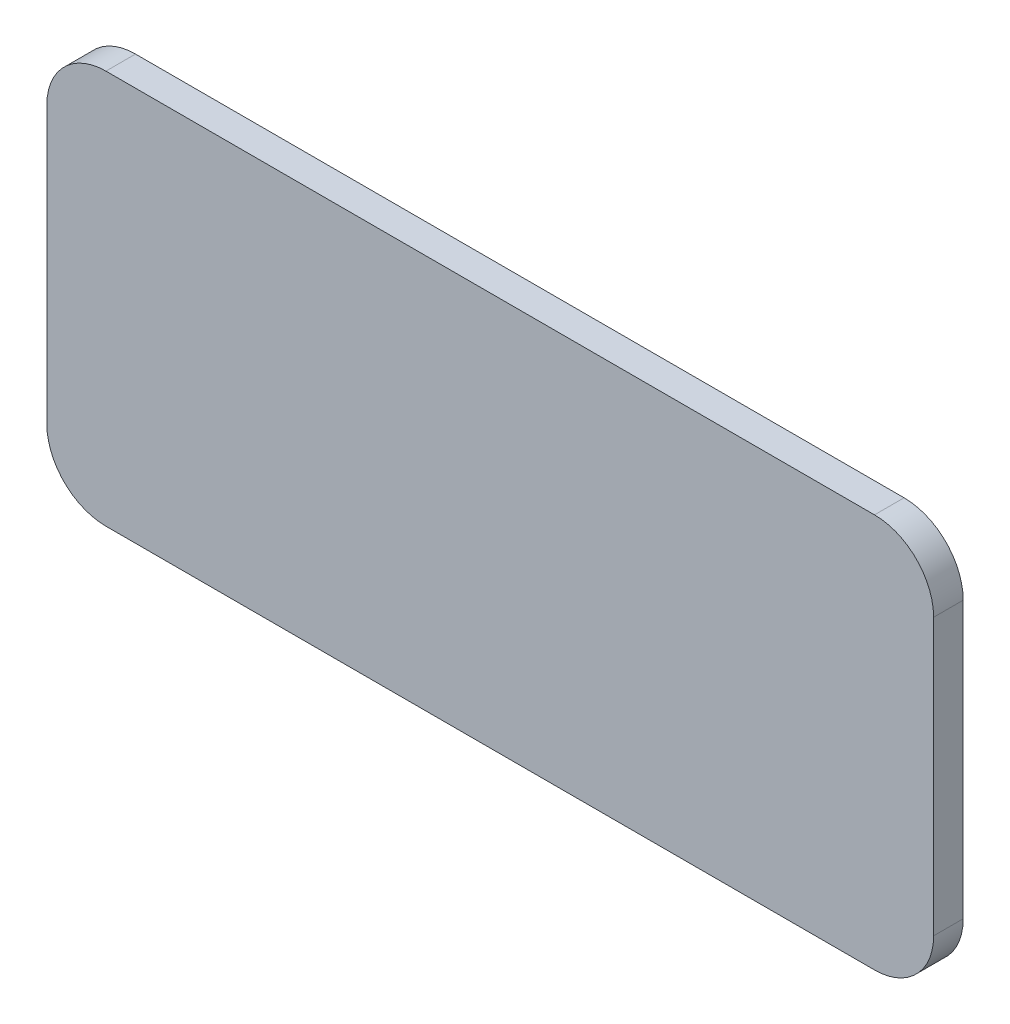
ISO-10303-21;
HEADER;
FILE_DESCRIPTION(('STEP AP214'),'2;1');
FILE_NAME('part.step','',(''),(''),'','','');
FILE_SCHEMA(('AUTOMOTIVE_DESIGN { 1 0 10303 214 1 1 1 1 }'));
ENDSEC;
DATA;
#1=APPLICATION_CONTEXT('core data for automotive mechanical design processes');
#2=APPLICATION_PROTOCOL_DEFINITION('international standard','automotive_design',2000,#1);
#3=PRODUCT_CONTEXT('',#1,'mechanical');
#4=PRODUCT('Part','Part','',(#3));
#5=PRODUCT_RELATED_PRODUCT_CATEGORY('part','',(#4));
#6=PRODUCT_DEFINITION_FORMATION('','',#4);
#7=PRODUCT_DEFINITION_CONTEXT('part definition',#1,'design');
#8=PRODUCT_DEFINITION('design','',#6,#7);
#9=PRODUCT_DEFINITION_SHAPE('','',#8);
#10=(LENGTH_UNIT() NAMED_UNIT(*) SI_UNIT(.MILLI.,.METRE.));
#11=(NAMED_UNIT(*) PLANE_ANGLE_UNIT() SI_UNIT($,.RADIAN.));
#12=(NAMED_UNIT(*) SI_UNIT($,.STERADIAN.) SOLID_ANGLE_UNIT());
#13=UNCERTAINTY_MEASURE_WITH_UNIT(LENGTH_MEASURE(1.E-05),#10,'distance_accuracy_value','');
#14=(GEOMETRIC_REPRESENTATION_CONTEXT(3) GLOBAL_UNCERTAINTY_ASSIGNED_CONTEXT((#13)) GLOBAL_UNIT_ASSIGNED_CONTEXT((#10,
#11,#12)) REPRESENTATION_CONTEXT('',''));
#15=CARTESIAN_POINT('',(0.,0.,0.));
#16=DIRECTION('',(0.,0.,1.));
#17=DIRECTION('',(1.,0.,0.));
#18=AXIS2_PLACEMENT_3D('',#15,#16,#17);
#19=CARTESIAN_POINT('',(58.,34.5,1.5));
#20=DIRECTION('',(0.,0.,-1.));
#21=DIRECTION('',(-1.,0.,0.));
#22=AXIS2_PLACEMENT_3D('',#19,#20,#21);
#23=CYLINDRICAL_SURFACE('',#22,3.);
#24=CARTESIAN_POINT('',(58.,34.5,0.));
#25=DIRECTION('',(0.,0.,1.));
#26=DIRECTION('',(1.,0.,0.));
#27=AXIS2_PLACEMENT_3D('',#24,#25,#26);
#28=CIRCLE('',#27,3.);
#29=CARTESIAN_POINT('',(58.,37.5,0.));
#30=VERTEX_POINT('',#29);
#31=CARTESIAN_POINT('',(55.,34.5,0.));
#32=VERTEX_POINT('',#31);
#33=EDGE_CURVE('E128',#30,#32,#28,.T.);
#34=ORIENTED_EDGE('',*,*,#33,.T.);
#35=DIRECTION('',(0.,0.,-1.));
#36=VECTOR('',#35,1.);
#37=CARTESIAN_POINT('',(55.,34.5,1.5));
#38=LINE('',#37,#36);
#39=CARTESIAN_POINT('',(55.,34.5,1.5));
#40=VERTEX_POINT('',#39);
#41=EDGE_CURVE('E11',#40,#32,#38,.T.);
#42=ORIENTED_EDGE('',*,*,#41,.F.);
#43=CARTESIAN_POINT('',(58.,34.5,1.5));
#44=DIRECTION('',(0.,0.,1.));
#45=DIRECTION('',(1.,0.,0.));
#46=AXIS2_PLACEMENT_3D('',#43,#44,#45);
#47=CIRCLE('',#46,3.);
#48=CARTESIAN_POINT('',(58.,37.5,1.5));
#49=VERTEX_POINT('',#48);
#50=EDGE_CURVE('E142',#49,#40,#47,.T.);
#51=ORIENTED_EDGE('',*,*,#50,.F.);
#52=DIRECTION('',(0.,0.,-1.));
#53=VECTOR('',#52,1.);
#54=CARTESIAN_POINT('',(58.,37.5,1.5));
#55=LINE('',#54,#53);
#56=EDGE_CURVE('E124',#49,#30,#55,.T.);
#57=ORIENTED_EDGE('',*,*,#56,.T.);
#58=EDGE_LOOP('',(#34,#42,#51,#57));
#59=FACE_BOUND('',#58,.T.);
#60=ADVANCED_FACE('F32',(#59),#23,.T.);
#61=CARTESIAN_POINT('',(55.,34.5,1.5));
#62=DIRECTION('',(1.,0.,0.));
#63=DIRECTION('',(0.,0.,-1.));
#64=AXIS2_PLACEMENT_3D('',#61,#62,#63);
#65=PLANE('',#64);
#66=DIRECTION('',(0.,-1.,0.));
#67=VECTOR('',#66,1.);
#68=CARTESIAN_POINT('',(55.,34.5,0.));
#69=LINE('',#68,#67);
#70=CARTESIAN_POINT('',(55.,20.5,0.));
#71=VERTEX_POINT('',#70);
#72=EDGE_CURVE('E131',#32,#71,#69,.T.);
#73=ORIENTED_EDGE('',*,*,#72,.T.);
#74=DIRECTION('',(0.,0.,-1.));
#75=VECTOR('',#74,1.);
#76=CARTESIAN_POINT('',(55.,20.5,1.5));
#77=LINE('',#76,#75);
#78=CARTESIAN_POINT('',(55.,20.5,1.5));
#79=VERTEX_POINT('',#78);
#80=EDGE_CURVE('E40',#79,#71,#77,.T.);
#81=ORIENTED_EDGE('',*,*,#80,.F.);
#82=DIRECTION('',(0.,-1.,0.));
#83=VECTOR('',#82,1.);
#84=CARTESIAN_POINT('',(55.,34.5,1.5));
#85=LINE('',#84,#83);
#86=EDGE_CURVE('E91',#40,#79,#85,.T.);
#87=ORIENTED_EDGE('',*,*,#86,.F.);
#88=ORIENTED_EDGE('',*,*,#41,.T.);
#89=EDGE_LOOP('',(#73,#81,#87,#88));
#90=FACE_BOUND('',#89,.T.);
#91=ADVANCED_FACE('F177',(#90),#65,.F.);
#92=CARTESIAN_POINT('',(58.,20.5,1.5));
#93=DIRECTION('',(0.,0.,-1.));
#94=DIRECTION('',(-1.,0.,0.));
#95=AXIS2_PLACEMENT_3D('',#92,#93,#94);
#96=CYLINDRICAL_SURFACE('',#95,3.);
#97=CARTESIAN_POINT('',(58.,20.5,0.));
#98=DIRECTION('',(0.,0.,1.));
#99=DIRECTION('',(1.,0.,0.));
#100=AXIS2_PLACEMENT_3D('',#97,#98,#99);
#101=CIRCLE('',#100,3.);
#102=CARTESIAN_POINT('',(58.,17.5,0.));
#103=VERTEX_POINT('',#102);
#104=EDGE_CURVE('E133',#71,#103,#101,.T.);
#105=ORIENTED_EDGE('',*,*,#104,.T.);
#106=DIRECTION('',(0.,0.,-1.));
#107=VECTOR('',#106,1.);
#108=CARTESIAN_POINT('',(58.,17.5,1.5));
#109=LINE('',#108,#107);
#110=CARTESIAN_POINT('',(58.,17.5,1.5));
#111=VERTEX_POINT('',#110);
#112=EDGE_CURVE('E149',#111,#103,#109,.T.);
#113=ORIENTED_EDGE('',*,*,#112,.F.);
#114=CARTESIAN_POINT('',(58.,20.5,1.5));
#115=DIRECTION('',(0.,0.,1.));
#116=DIRECTION('',(1.,0.,0.));
#117=AXIS2_PLACEMENT_3D('',#114,#115,#116);
#118=CIRCLE('',#117,3.);
#119=EDGE_CURVE('E157',#79,#111,#118,.T.);
#120=ORIENTED_EDGE('',*,*,#119,.F.);
#121=ORIENTED_EDGE('',*,*,#80,.T.);
#122=EDGE_LOOP('',(#105,#113,#120,#121));
#123=FACE_BOUND('',#122,.T.);
#124=ADVANCED_FACE('F155',(#123),#96,.T.);
#125=CARTESIAN_POINT('',(58.,17.5,1.5));
#126=DIRECTION('',(0.,1.,0.));
#127=DIRECTION('',(-1.,0.,0.));
#128=AXIS2_PLACEMENT_3D('',#125,#126,#127);
#129=PLANE('',#128);
#130=DIRECTION('',(1.,0.,0.));
#131=VECTOR('',#130,1.);
#132=CARTESIAN_POINT('',(58.,17.5,0.));
#133=LINE('',#132,#131);
#134=CARTESIAN_POINT('',(97.,17.5,0.));
#135=VERTEX_POINT('',#134);
#136=EDGE_CURVE('E135',#103,#135,#133,.T.);
#137=ORIENTED_EDGE('',*,*,#136,.T.);
#138=DIRECTION('',(0.,0.,-1.));
#139=VECTOR('',#138,1.);
#140=CARTESIAN_POINT('',(97.,17.5,1.5));
#141=LINE('',#140,#139);
#142=CARTESIAN_POINT('',(97.,17.5,1.5));
#143=VERTEX_POINT('',#142);
#144=EDGE_CURVE('E146',#143,#135,#141,.T.);
#145=ORIENTED_EDGE('',*,*,#144,.F.);
#146=DIRECTION('',(1.,0.,0.));
#147=VECTOR('',#146,1.);
#148=CARTESIAN_POINT('',(58.,17.5,1.5));
#149=LINE('',#148,#147);
#150=EDGE_CURVE('E169',#111,#143,#149,.T.);
#151=ORIENTED_EDGE('',*,*,#150,.F.);
#152=ORIENTED_EDGE('',*,*,#112,.T.);
#153=EDGE_LOOP('',(#137,#145,#151,#152));
#154=FACE_BOUND('',#153,.T.);
#155=ADVANCED_FACE('F165',(#154),#129,.F.);
#156=CARTESIAN_POINT('',(97.,20.5,1.5));
#157=DIRECTION('',(0.,0.,-1.));
#158=DIRECTION('',(-1.,0.,0.));
#159=AXIS2_PLACEMENT_3D('',#156,#157,#158);
#160=CYLINDRICAL_SURFACE('',#159,3.);
#161=CARTESIAN_POINT('',(97.,20.5,0.));
#162=DIRECTION('',(0.,0.,1.));
#163=DIRECTION('',(1.,0.,0.));
#164=AXIS2_PLACEMENT_3D('',#161,#162,#163);
#165=CIRCLE('',#164,3.);
#166=CARTESIAN_POINT('',(100.,20.5,0.));
#167=VERTEX_POINT('',#166);
#168=EDGE_CURVE('E137',#135,#167,#165,.T.);
#169=ORIENTED_EDGE('',*,*,#168,.T.);
#170=DIRECTION('',(0.,0.,-1.));
#171=VECTOR('',#170,1.);
#172=CARTESIAN_POINT('',(100.,20.5,1.5));
#173=LINE('',#172,#171);
#174=CARTESIAN_POINT('',(100.,20.5,1.5));
#175=VERTEX_POINT('',#174);
#176=EDGE_CURVE('E119',#175,#167,#173,.T.);
#177=ORIENTED_EDGE('',*,*,#176,.F.);
#178=CARTESIAN_POINT('',(97.,20.5,1.5));
#179=DIRECTION('',(0.,0.,1.));
#180=DIRECTION('',(1.,0.,0.));
#181=AXIS2_PLACEMENT_3D('',#178,#179,#180);
#182=CIRCLE('',#181,3.);
#183=EDGE_CURVE('E110',#143,#175,#182,.T.);
#184=ORIENTED_EDGE('',*,*,#183,.F.);
#185=ORIENTED_EDGE('',*,*,#144,.T.);
#186=EDGE_LOOP('',(#169,#177,#184,#185));
#187=FACE_BOUND('',#186,.T.);
#188=ADVANCED_FACE('F168',(#187),#160,.T.);
#189=CARTESIAN_POINT('',(100.,20.5,1.5));
#190=DIRECTION('',(-1.,0.,0.));
#191=DIRECTION('',(0.,0.,1.));
#192=AXIS2_PLACEMENT_3D('',#189,#190,#191);
#193=PLANE('',#192);
#194=DIRECTION('',(0.,1.,0.));
#195=VECTOR('',#194,1.);
#196=CARTESIAN_POINT('',(100.,20.5,0.));
#197=LINE('',#196,#195);
#198=CARTESIAN_POINT('',(100.,34.5,0.));
#199=VERTEX_POINT('',#198);
#200=EDGE_CURVE('E118',#167,#199,#197,.T.);
#201=ORIENTED_EDGE('',*,*,#200,.T.);
#202=DIRECTION('',(0.,0.,-1.));
#203=VECTOR('',#202,1.);
#204=CARTESIAN_POINT('',(100.,34.5,1.5));
#205=LINE('',#204,#203);
#206=CARTESIAN_POINT('',(100.,34.5,1.5));
#207=VERTEX_POINT('',#206);
#208=EDGE_CURVE('E115',#207,#199,#205,.T.);
#209=ORIENTED_EDGE('',*,*,#208,.F.);
#210=DIRECTION('',(0.,1.,0.));
#211=VECTOR('',#210,1.);
#212=CARTESIAN_POINT('',(100.,20.5,1.5));
#213=LINE('',#212,#211);
#214=EDGE_CURVE('E104',#175,#207,#213,.T.);
#215=ORIENTED_EDGE('',*,*,#214,.F.);
#216=ORIENTED_EDGE('',*,*,#176,.T.);
#217=EDGE_LOOP('',(#201,#209,#215,#216));
#218=FACE_BOUND('',#217,.T.);
#219=ADVANCED_FACE('F116',(#218),#193,.F.);
#220=CARTESIAN_POINT('',(97.,34.5,1.5));
#221=DIRECTION('',(0.,0.,-1.));
#222=DIRECTION('',(-1.,0.,0.));
#223=AXIS2_PLACEMENT_3D('',#220,#221,#222);
#224=CYLINDRICAL_SURFACE('',#223,3.);
#225=CARTESIAN_POINT('',(97.,34.5,0.));
#226=DIRECTION('',(0.,0.,1.));
#227=DIRECTION('',(1.,0.,0.));
#228=AXIS2_PLACEMENT_3D('',#225,#226,#227);
#229=CIRCLE('',#228,3.);
#230=CARTESIAN_POINT('',(97.,37.5,0.));
#231=VERTEX_POINT('',#230);
#232=EDGE_CURVE('E77',#199,#231,#229,.T.);
#233=ORIENTED_EDGE('',*,*,#232,.T.);
#234=DIRECTION('',(0.,0.,-1.));
#235=VECTOR('',#234,1.);
#236=CARTESIAN_POINT('',(97.,37.5,1.5));
#237=LINE('',#236,#235);
#238=CARTESIAN_POINT('',(97.,37.5,1.5));
#239=VERTEX_POINT('',#238);
#240=EDGE_CURVE('E120',#239,#231,#237,.T.);
#241=ORIENTED_EDGE('',*,*,#240,.F.);
#242=CARTESIAN_POINT('',(97.,34.5,1.5));
#243=DIRECTION('',(0.,0.,1.));
#244=DIRECTION('',(1.,0.,0.));
#245=AXIS2_PLACEMENT_3D('',#242,#243,#244);
#246=CIRCLE('',#245,3.);
#247=EDGE_CURVE('E108',#207,#239,#246,.T.);
#248=ORIENTED_EDGE('',*,*,#247,.F.);
#249=ORIENTED_EDGE('',*,*,#208,.T.);
#250=EDGE_LOOP('',(#233,#241,#248,#249));
#251=FACE_BOUND('',#250,.T.);
#252=ADVANCED_FACE('F122',(#251),#224,.T.);
#253=CARTESIAN_POINT('',(97.,37.5,1.5));
#254=DIRECTION('',(0.,-1.,0.));
#255=DIRECTION('',(1.,0.,0.));
#256=AXIS2_PLACEMENT_3D('',#253,#254,#255);
#257=PLANE('',#256);
#258=DIRECTION('',(-1.,0.,0.));
#259=VECTOR('',#258,1.);
#260=CARTESIAN_POINT('',(97.,37.5,0.));
#261=LINE('',#260,#259);
#262=EDGE_CURVE('E83',#231,#30,#261,.T.);
#263=ORIENTED_EDGE('',*,*,#262,.T.);
#264=ORIENTED_EDGE('',*,*,#56,.F.);
#265=DIRECTION('',(-1.,0.,0.));
#266=VECTOR('',#265,1.);
#267=CARTESIAN_POINT('',(97.,37.5,1.5));
#268=LINE('',#267,#266);
#269=EDGE_CURVE('E48',#239,#49,#268,.T.);
#270=ORIENTED_EDGE('',*,*,#269,.F.);
#271=ORIENTED_EDGE('',*,*,#240,.T.);
#272=EDGE_LOOP('',(#263,#264,#270,#271));
#273=FACE_BOUND('',#272,.T.);
#274=ADVANCED_FACE('F193',(#273),#257,.F.);
#275=CARTESIAN_POINT('',(58.,34.5,1.5));
#276=DIRECTION('',(0.,0.,1.));
#277=DIRECTION('',(1.,0.,0.));
#278=AXIS2_PLACEMENT_3D('',#275,#276,#277);
#279=PLANE('',#278);
#280=ORIENTED_EDGE('',*,*,#50,.T.);
#281=ORIENTED_EDGE('',*,*,#86,.T.);
#282=ORIENTED_EDGE('',*,*,#119,.T.);
#283=ORIENTED_EDGE('',*,*,#150,.T.);
#284=ORIENTED_EDGE('',*,*,#183,.T.);
#285=ORIENTED_EDGE('',*,*,#214,.T.);
#286=ORIENTED_EDGE('',*,*,#247,.T.);
#287=ORIENTED_EDGE('',*,*,#269,.T.);
#288=EDGE_LOOP('',(#280,#281,#282,#283,#284,#285,#286,#287));
#289=FACE_BOUND('',#288,.T.);
#290=ADVANCED_FACE('F106',(#289),#279,.T.);
#291=CARTESIAN_POINT('',(58.,34.5,0.));
#292=DIRECTION('',(0.,0.,1.));
#293=DIRECTION('',(1.,0.,0.));
#294=AXIS2_PLACEMENT_3D('',#291,#292,#293);
#295=PLANE('',#294);
#296=ORIENTED_EDGE('',*,*,#33,.F.);
#297=ORIENTED_EDGE('',*,*,#262,.F.);
#298=ORIENTED_EDGE('',*,*,#232,.F.);
#299=ORIENTED_EDGE('',*,*,#200,.F.);
#300=ORIENTED_EDGE('',*,*,#168,.F.);
#301=ORIENTED_EDGE('',*,*,#136,.F.);
#302=ORIENTED_EDGE('',*,*,#104,.F.);
#303=ORIENTED_EDGE('',*,*,#72,.F.);
#304=EDGE_LOOP('',(#296,#297,#298,#299,#300,#301,#302,#303));
#305=FACE_BOUND('',#304,.T.);
#306=ADVANCED_FACE('F161',(#305),#295,.F.);
#307=CLOSED_SHELL('',(#60,#91,#124,#155,#188,#219,#252,#274,#290,#306));
#308=MANIFOLD_SOLID_BREP('B2',#307);
#309=ADVANCED_BREP_SHAPE_REPRESENTATION('',(#18,#308),#14);
#310=SHAPE_DEFINITION_REPRESENTATION(#9,#309);
ENDSEC;
END-ISO-10303-21;
